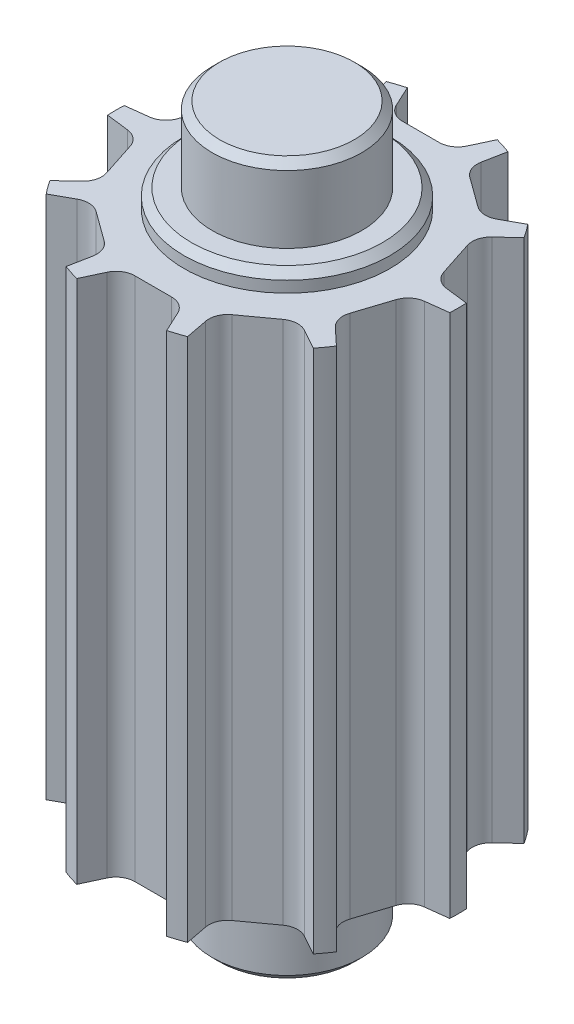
from build123d import *

# Parameters (mm, degrees)
SKIZZE1_R                       = 4.57
AUFSATZ_LINEAR_AUSTRAGEN1_DEPTH = 19
SCHNITT_LINEAR_AUSTRAGEN1_DEPTH = 21.069125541
VERRUNDUNG1_R                   = 0.5
KREISMUSTER1_COUNT              = 10
VERRUNDUNG1_OF_KREISMUSTER1_R   = 0.5
FASE1_SIZE                      = 0.2


with BuildPart() as part:
    # Skizze1 → Aufsatz-Linear austragen1 (new body)
    with BuildSketch(Plane(origin=(0, 0, 0), x_dir=(1, 0, 0), z_dir=(0, 1, 0))):
        with Locations(Location((0, 0, 0), (0, 0, 270))):
            Circle(SKIZZE1_R)
    extrude(amount=AUFSATZ_LINEAR_AUSTRAGEN1_DEPTH)

    # Skizze12 → Schnitt-Linear austragen1 (cut, through all)
    with BuildSketch(Plane(origin=(0, 19, 0), x_dir=(1, 0, 0), z_dir=(0, 1, 0))):
        with BuildLine():
            Line((-1.2, 4.409637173), (-0.808470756, 3.57))
            Line((-0.808470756, 3.57), (0.808470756, 3.57))
            Line((0.808470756, 3.57), (1.2, 4.409637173))
            ThreePointArc((1.2, 4.409637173), (0, 4.57), (-1.2, 4.409637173))
        make_face()
    schnitt_linear_austragen1 = extrude(amount=-SCHNITT_LINEAR_AUSTRAGEN1_DEPTH, mode=Mode.SUBTRACT)

    # Verrundung1
    verrundung1_edges = [part.edges().sort_by_distance(p)[0] for p in [
        (0.808470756, 9.5, -3.57),
        (-0.808470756, 9.5, -3.57),
    ]]
    fillet(verrundung1_edges, radius=VERRUNDUNG1_R)

    # Kreismuster1: Schnitt-Linear austragen1 ×10 about axis
    kreismuster1_axis = Axis((0, 0, 0), (0, 1, 0))
    for i in range(1, KREISMUSTER1_COUNT):
        add(schnitt_linear_austragen1.rotate(kreismuster1_axis, i * 360 / KREISMUSTER1_COUNT), mode=Mode.SUBTRACT)

    # Verrundung1 of Kreismuster1
    verrundung1_of_kreismuster1_edges = [part.edges().sort_by_distance(p)[0] for p in [
        (-1.44432677, 9.5, -3.363397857),
        (-2.752459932, 9.5, -2.412983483),
        (-3.14544056, 9.5, -1.872092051),
        (-3.645102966, 9.5, -0.334289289),
        (-3.645102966, 9.5, 0.334289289),
        (-3.14544056, 9.5, 1.872092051),
        (-2.752459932, 9.5, 2.412983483),
        (-1.44432677, 9.5, 3.363397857),
        (-0.808470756, 9.5, 3.57),
        (0.808470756, 9.5, 3.57),
        (1.44432677, 9.5, 3.363397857),
        (2.752459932, 9.5, 2.412983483),
        (3.14544056, 9.5, 1.872092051),
        (3.645102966, 9.5, 0.334289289),
        (3.645102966, 9.5, -0.334289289),
        (3.14544056, 9.5, -1.872092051),
        (2.752459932, 9.5, -2.412983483),
        (1.44432677, 9.5, -3.363397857),
    ]]
    fillet(verrundung1_of_kreismuster1_edges, radius=VERRUNDUNG1_OF_KREISMUSTER1_R)

    # Skizze13 → Schnitt-Rotation1 (revolve, cut)
    with BuildSketch(Plane(origin=(0, 0, 0), x_dir=(0, 0, -1), z_dir=(1, 0, 0)), mode=Mode.PRIVATE) as schnitt_rotation1_sk:
        Polygon((-1.995, 0), (-10.076763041, 0), (-10.076763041, 19), (-1.995, 19), (-1.995, 17), (-2.75, 17), (-2.75, 16.5), (-6.450923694, 16.5), (-6.450923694, 2.5), (-2.75, 2.5), (-2.75, 2), (-1.995, 2), align=None)
    revolve(schnitt_rotation1_sk.sketch.rotate(Axis((0, -5.607699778, 0), (0, 1, 0)), 180), axis=Axis((0, -5.607699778, 0), (0, 1, 0)), mode=Mode.SUBTRACT)

    # Fase1
    fase1_edges = [part.edges().sort_by_distance(p)[0] for p in [
        (0, 19, 1.995),
        (0, 0, 1.995),
        (0, 2, 2.75),
        (0, 17, 2.75),
    ]]
    chamfer(fase1_edges, length=FASE1_SIZE)

    # Skizze14 → Schnitt-Rotation2 (revolve, cut)
    with BuildSketch(Plane(origin=(0, 0, 0), x_dir=(0, 0, -1), z_dir=(1, 0, 0))):
        Polygon((0, 0), (-0.6, 0), (-0.6, 1.5), (0, 1.748528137), align=None)
    revolve(axis=Axis((0, -2.816169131, 0), (0, 1, 0)), mode=Mode.SUBTRACT)


solid = part.part
